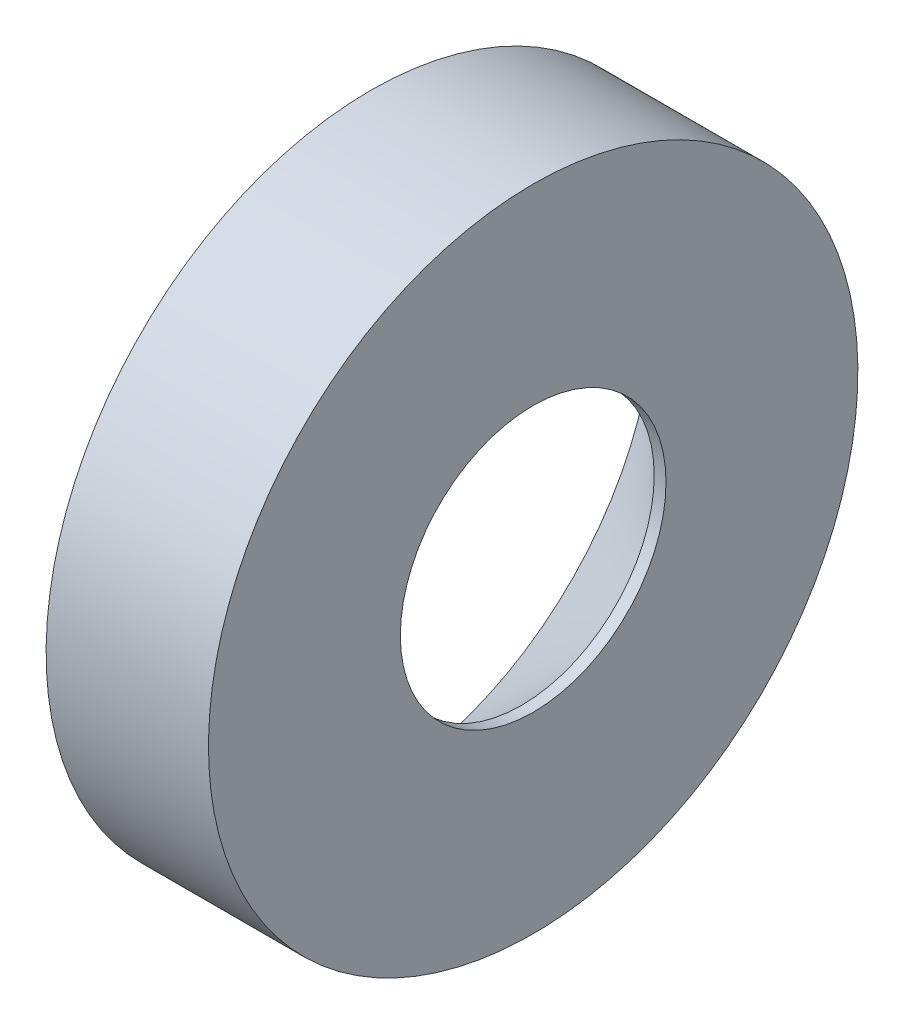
ISO-10303-21;
HEADER;
FILE_DESCRIPTION(('STEP AP214'),'2;1');
FILE_NAME('part.step','',(''),(''),'','','');
FILE_SCHEMA(('AUTOMOTIVE_DESIGN { 1 0 10303 214 1 1 1 1 }'));
ENDSEC;
DATA;
#1=APPLICATION_CONTEXT('core data for automotive mechanical design processes');
#2=APPLICATION_PROTOCOL_DEFINITION('international standard','automotive_design',2000,#1);
#3=PRODUCT_CONTEXT('',#1,'mechanical');
#4=PRODUCT('Part','Part','',(#3));
#5=PRODUCT_RELATED_PRODUCT_CATEGORY('part','',(#4));
#6=PRODUCT_DEFINITION_FORMATION('','',#4);
#7=PRODUCT_DEFINITION_CONTEXT('part definition',#1,'design');
#8=PRODUCT_DEFINITION('design','',#6,#7);
#9=PRODUCT_DEFINITION_SHAPE('','',#8);
#10=(LENGTH_UNIT() NAMED_UNIT(*) SI_UNIT(.MILLI.,.METRE.));
#11=(NAMED_UNIT(*) PLANE_ANGLE_UNIT() SI_UNIT($,.RADIAN.));
#12=(NAMED_UNIT(*) SI_UNIT($,.STERADIAN.) SOLID_ANGLE_UNIT());
#13=UNCERTAINTY_MEASURE_WITH_UNIT(LENGTH_MEASURE(1.E-05),#10,'distance_accuracy_value','');
#14=(GEOMETRIC_REPRESENTATION_CONTEXT(3) GLOBAL_UNCERTAINTY_ASSIGNED_CONTEXT((#13)) GLOBAL_UNIT_ASSIGNED_CONTEXT((#10,
#11,#12)) REPRESENTATION_CONTEXT('',''));
#15=CARTESIAN_POINT('',(0.,0.,0.));
#16=DIRECTION('',(0.,0.,1.));
#17=DIRECTION('',(1.,0.,0.));
#18=AXIS2_PLACEMENT_3D('',#15,#16,#17);
#19=CARTESIAN_POINT('',(4.33812691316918,-3.05587946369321,0.));
#20=DIRECTION('',(1.,0.,0.));
#21=DIRECTION('',(0.,1.,0.));
#22=AXIS2_PLACEMENT_3D('',#19,#20,#21);
#23=CYLINDRICAL_SURFACE('',#22,4.5);
#24=CARTESIAN_POINT('',(4.53812691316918,-3.05587946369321,0.));
#25=DIRECTION('',(1.,0.,0.));
#26=DIRECTION('',(0.,1.,0.));
#27=AXIS2_PLACEMENT_3D('',#24,#25,#26);
#28=CIRCLE('',#27,4.5);
#29=CARTESIAN_POINT('',(4.53812691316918,1.44412053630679,0.));
#30=VERTEX_POINT('',#29);
#31=EDGE_CURVE('E18',#30,#30,#28,.F.);
#32=ORIENTED_EDGE('',*,*,#31,.F.);
#33=EDGE_LOOP('',(#32));
#34=FACE_BOUND('',#33,.T.);
#35=CARTESIAN_POINT('',(4.13812691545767,-3.05587946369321,0.));
#36=DIRECTION('',(-1.,0.,0.));
#37=DIRECTION('',(0.,1.,0.));
#38=AXIS2_PLACEMENT_3D('',#35,#36,#37);
#39=CIRCLE('',#38,4.50000000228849);
#40=CARTESIAN_POINT('',(4.13812691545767,1.44412053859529,0.));
#41=VERTEX_POINT('',#40);
#42=EDGE_CURVE('E36',#41,#41,#39,.T.);
#43=ORIENTED_EDGE('',*,*,#42,.T.);
#44=EDGE_LOOP('',(#43));
#45=FACE_BOUND('',#44,.T.);
#46=ADVANCED_FACE('F15',(#34,#45),#23,.F.);
#47=CARTESIAN_POINT('',(-0.961873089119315,-3.05587946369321,0.));
#48=DIRECTION('',(-1.,0.,0.));
#49=DIRECTION('',(0.,-1.,0.));
#50=AXIS2_PLACEMENT_3D('',#47,#48,#49);
#51=CONICAL_SURFACE('',#50,9.5999999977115,0.7853981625);
#52=ORIENTED_EDGE('',*,*,#42,.F.);
#53=EDGE_LOOP('',(#52));
#54=FACE_BOUND('',#53,.T.);
#55=CARTESIAN_POINT('',(-0.961873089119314,-3.05587946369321,0.));
#56=DIRECTION('',(-1.,0.,0.));
#57=DIRECTION('',(0.,-1.,0.));
#58=AXIS2_PLACEMENT_3D('',#55,#56,#57);
#59=CIRCLE('',#58,9.5999999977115);
#60=CARTESIAN_POINT('',(-0.961873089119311,-12.6558794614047,0.));
#61=VERTEX_POINT('',#60);
#62=EDGE_CURVE('E27',#61,#61,#59,.F.);
#63=ORIENTED_EDGE('',*,*,#62,.F.);
#64=EDGE_LOOP('',(#63));
#65=FACE_BOUND('',#64,.T.);
#66=ADVANCED_FACE('F43',(#54,#65),#51,.F.);
#67=CARTESIAN_POINT('',(4.53812691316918,4.6941205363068,0.));
#68=DIRECTION('',(1.,0.,0.));
#69=DIRECTION('',(0.,0.,-1.));
#70=AXIS2_PLACEMENT_3D('',#67,#68,#69);
#71=PLANE('',#70);
#72=ORIENTED_EDGE('',*,*,#31,.T.);
#73=EDGE_LOOP('',(#72));
#74=FACE_BOUND('',#73,.T.);
#75=CARTESIAN_POINT('',(4.53812691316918,-3.05587946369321,0.));
#76=DIRECTION('',(1.,0.,0.));
#77=DIRECTION('',(0.,1.,0.));
#78=AXIS2_PLACEMENT_3D('',#75,#76,#77);
#79=CIRCLE('',#78,11.);
#80=CARTESIAN_POINT('',(4.53812691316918,7.94412053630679,0.));
#81=VERTEX_POINT('',#80);
#82=EDGE_CURVE('E22',#81,#81,#79,.F.);
#83=ORIENTED_EDGE('',*,*,#82,.F.);
#84=EDGE_LOOP('',(#83));
#85=FACE_BOUND('',#84,.T.);
#86=ADVANCED_FACE('F46',(#74,#85),#71,.T.);
#87=CARTESIAN_POINT('',(-0.961873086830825,7.24412053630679,0.));
#88=DIRECTION('',(-1.,0.,0.));
#89=DIRECTION('',(0.,0.,1.));
#90=AXIS2_PLACEMENT_3D('',#87,#88,#89);
#91=PLANE('',#90);
#92=ORIENTED_EDGE('',*,*,#62,.T.);
#93=EDGE_LOOP('',(#92));
#94=FACE_BOUND('',#93,.T.);
#95=CARTESIAN_POINT('',(-0.961873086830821,-3.05587946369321,0.));
#96=DIRECTION('',(1.,0.,0.));
#97=DIRECTION('',(0.,1.,0.));
#98=AXIS2_PLACEMENT_3D('',#95,#96,#97);
#99=CIRCLE('',#98,11.);
#100=CARTESIAN_POINT('',(-0.961873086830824,7.94412053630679,0.));
#101=VERTEX_POINT('',#100);
#102=EDGE_CURVE('E10',#101,#101,#99,.T.);
#103=ORIENTED_EDGE('',*,*,#102,.F.);
#104=EDGE_LOOP('',(#103));
#105=FACE_BOUND('',#104,.T.);
#106=ADVANCED_FACE('F52',(#94,#105),#91,.T.);
#107=CARTESIAN_POINT('',(1.78812691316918,-3.05587946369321,0.));
#108=DIRECTION('',(1.,0.,0.));
#109=DIRECTION('',(0.,1.,0.));
#110=AXIS2_PLACEMENT_3D('',#107,#108,#109);
#111=CYLINDRICAL_SURFACE('',#110,11.);
#112=ORIENTED_EDGE('',*,*,#102,.T.);
#113=EDGE_LOOP('',(#112));
#114=FACE_BOUND('',#113,.T.);
#115=ORIENTED_EDGE('',*,*,#82,.T.);
#116=EDGE_LOOP('',(#115));
#117=FACE_BOUND('',#116,.T.);
#118=ADVANCED_FACE('F55',(#114,#117),#111,.T.);
#119=CLOSED_SHELL('',(#46,#66,#86,#106,#118));
#120=MANIFOLD_SOLID_BREP('B1',#119);
#121=ADVANCED_BREP_SHAPE_REPRESENTATION('',(#18,#120),#14);
#122=SHAPE_DEFINITION_REPRESENTATION(#9,#121);
ENDSEC;
END-ISO-10303-21;
